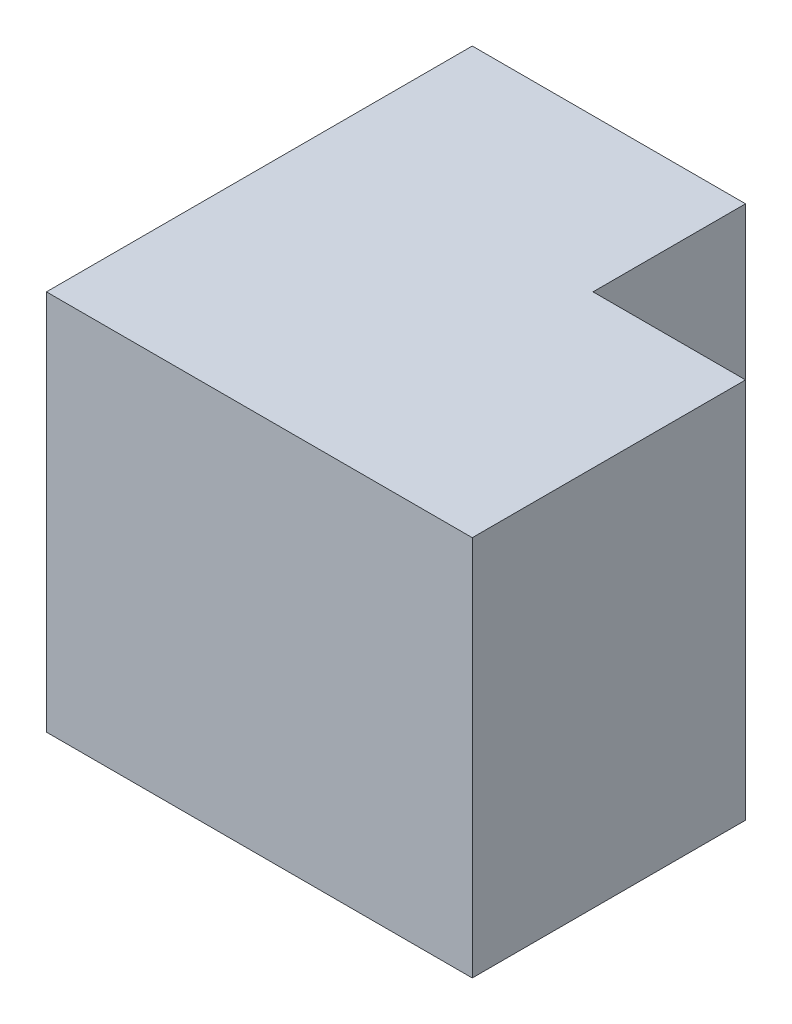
ISO-10303-21;
HEADER;
FILE_DESCRIPTION(('STEP AP214'),'2;1');
FILE_NAME('part.step','',(''),(''),'','','');
FILE_SCHEMA(('AUTOMOTIVE_DESIGN { 1 0 10303 214 1 1 1 1 }'));
ENDSEC;
DATA;
#1=APPLICATION_CONTEXT('core data for automotive mechanical design processes');
#2=APPLICATION_PROTOCOL_DEFINITION('international standard','automotive_design',2000,#1);
#3=PRODUCT_CONTEXT('',#1,'mechanical');
#4=PRODUCT('Part','Part','',(#3));
#5=PRODUCT_RELATED_PRODUCT_CATEGORY('part','',(#4));
#6=PRODUCT_DEFINITION_FORMATION('','',#4);
#7=PRODUCT_DEFINITION_CONTEXT('part definition',#1,'design');
#8=PRODUCT_DEFINITION('design','',#6,#7);
#9=PRODUCT_DEFINITION_SHAPE('','',#8);
#10=(LENGTH_UNIT() NAMED_UNIT(*) SI_UNIT(.MILLI.,.METRE.));
#11=(NAMED_UNIT(*) PLANE_ANGLE_UNIT() SI_UNIT($,.RADIAN.));
#12=(NAMED_UNIT(*) SI_UNIT($,.STERADIAN.) SOLID_ANGLE_UNIT());
#13=UNCERTAINTY_MEASURE_WITH_UNIT(LENGTH_MEASURE(1.E-05),#10,'distance_accuracy_value','');
#14=(GEOMETRIC_REPRESENTATION_CONTEXT(3) GLOBAL_UNCERTAINTY_ASSIGNED_CONTEXT((#13)) GLOBAL_UNIT_ASSIGNED_CONTEXT((#10,
#11,#12)) REPRESENTATION_CONTEXT('',''));
#15=CARTESIAN_POINT('',(0.,0.,0.));
#16=DIRECTION('',(0.,0.,1.));
#17=DIRECTION('',(1.,0.,0.));
#18=AXIS2_PLACEMENT_3D('',#15,#16,#17);
#19=CARTESIAN_POINT('',(9.50000000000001,60.,0.));
#20=DIRECTION('',(1.,0.,0.));
#21=DIRECTION('',(0.,0.,-1.));
#22=AXIS2_PLACEMENT_3D('',#19,#20,#21);
#23=PLANE('',#22);
#24=DIRECTION('',(0.,0.,1.));
#25=VECTOR('',#24,1.);
#26=CARTESIAN_POINT('',(9.50000000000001,0.,0.));
#27=LINE('',#26,#25);
#28=CARTESIAN_POINT('',(9.5,0.,-33.5));
#29=VERTEX_POINT('',#28);
#30=CARTESIAN_POINT('',(9.50000000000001,0.,-9.49999999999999));
#31=VERTEX_POINT('',#30);
#32=EDGE_CURVE('E114',#29,#31,#27,.T.);
#33=ORIENTED_EDGE('',*,*,#32,.F.);
#34=DIRECTION('',(0.,-1.,0.));
#35=VECTOR('',#34,1.);
#36=CARTESIAN_POINT('',(9.5,60.,-33.5));
#37=LINE('',#36,#35);
#38=CARTESIAN_POINT('',(9.5,60.,-33.5));
#39=VERTEX_POINT('',#38);
#40=EDGE_CURVE('E11',#39,#29,#37,.T.);
#41=ORIENTED_EDGE('',*,*,#40,.F.);
#42=DIRECTION('',(0.,0.,1.));
#43=VECTOR('',#42,1.);
#44=CARTESIAN_POINT('',(9.50000000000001,60.,0.));
#45=LINE('',#44,#43);
#46=CARTESIAN_POINT('',(9.50000000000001,60.,-9.49999999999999));
#47=VERTEX_POINT('',#46);
#48=EDGE_CURVE('E127',#39,#47,#45,.T.);
#49=ORIENTED_EDGE('',*,*,#48,.T.);
#50=DIRECTION('',(0.,-1.,0.));
#51=VECTOR('',#50,1.);
#52=CARTESIAN_POINT('',(9.50000000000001,60.,-9.49999999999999));
#53=LINE('',#52,#51);
#54=EDGE_CURVE('E76',#47,#31,#53,.T.);
#55=ORIENTED_EDGE('',*,*,#54,.T.);
#56=EDGE_LOOP('',(#33,#41,#49,#55));
#57=FACE_BOUND('',#56,.T.);
#58=ADVANCED_FACE('F32',(#57),#23,.T.);
#59=CARTESIAN_POINT('',(0.,60.,-33.5));
#60=DIRECTION('',(0.,0.,-1.));
#61=DIRECTION('',(-1.,0.,0.));
#62=AXIS2_PLACEMENT_3D('',#59,#60,#61);
#63=PLANE('',#62);
#64=DIRECTION('',(1.,0.,0.));
#65=VECTOR('',#64,1.);
#66=CARTESIAN_POINT('',(0.,0.,-33.5));
#67=LINE('',#66,#65);
#68=CARTESIAN_POINT('',(-33.5,0.,-33.5));
#69=VERTEX_POINT('',#68);
#70=EDGE_CURVE('E117',#69,#29,#67,.T.);
#71=ORIENTED_EDGE('',*,*,#70,.F.);
#72=DIRECTION('',(0.,-1.,0.));
#73=VECTOR('',#72,1.);
#74=CARTESIAN_POINT('',(-33.5,60.,-33.5));
#75=LINE('',#74,#73);
#76=CARTESIAN_POINT('',(-33.5,60.,-33.5));
#77=VERTEX_POINT('',#76);
#78=EDGE_CURVE('E40',#77,#69,#75,.T.);
#79=ORIENTED_EDGE('',*,*,#78,.F.);
#80=DIRECTION('',(1.,0.,0.));
#81=VECTOR('',#80,1.);
#82=CARTESIAN_POINT('',(0.,60.,-33.5));
#83=LINE('',#82,#81);
#84=EDGE_CURVE('E139',#77,#39,#83,.T.);
#85=ORIENTED_EDGE('',*,*,#84,.T.);
#86=ORIENTED_EDGE('',*,*,#40,.T.);
#87=EDGE_LOOP('',(#71,#79,#85,#86));
#88=FACE_BOUND('',#87,.T.);
#89=ADVANCED_FACE('F138',(#88),#63,.T.);
#90=CARTESIAN_POINT('',(-33.5,60.,0.));
#91=DIRECTION('',(1.,0.,0.));
#92=DIRECTION('',(0.,0.,-1.));
#93=AXIS2_PLACEMENT_3D('',#90,#91,#92);
#94=PLANE('',#93);
#95=DIRECTION('',(0.,0.,1.));
#96=VECTOR('',#95,1.);
#97=CARTESIAN_POINT('',(-33.5,0.,0.));
#98=LINE('',#97,#96);
#99=CARTESIAN_POINT('',(-33.5,0.,33.5));
#100=VERTEX_POINT('',#99);
#101=EDGE_CURVE('E120',#69,#100,#98,.T.);
#102=ORIENTED_EDGE('',*,*,#101,.T.);
#103=DIRECTION('',(0.,-1.,0.));
#104=VECTOR('',#103,1.);
#105=CARTESIAN_POINT('',(-33.5,60.,33.5));
#106=LINE('',#105,#104);
#107=CARTESIAN_POINT('',(-33.5,60.,33.5));
#108=VERTEX_POINT('',#107);
#109=EDGE_CURVE('E107',#108,#100,#106,.T.);
#110=ORIENTED_EDGE('',*,*,#109,.F.);
#111=DIRECTION('',(0.,0.,1.));
#112=VECTOR('',#111,1.);
#113=CARTESIAN_POINT('',(-33.5,60.,0.));
#114=LINE('',#113,#112);
#115=EDGE_CURVE('E94',#77,#108,#114,.T.);
#116=ORIENTED_EDGE('',*,*,#115,.F.);
#117=ORIENTED_EDGE('',*,*,#78,.T.);
#118=EDGE_LOOP('',(#102,#110,#116,#117));
#119=FACE_BOUND('',#118,.T.);
#120=ADVANCED_FACE('F132',(#119),#94,.F.);
#121=CARTESIAN_POINT('',(0.,60.,33.5));
#122=DIRECTION('',(0.,0.,-1.));
#123=DIRECTION('',(-1.,0.,0.));
#124=AXIS2_PLACEMENT_3D('',#121,#122,#123);
#125=PLANE('',#124);
#126=DIRECTION('',(1.,0.,0.));
#127=VECTOR('',#126,1.);
#128=CARTESIAN_POINT('',(0.,0.,33.5));
#129=LINE('',#128,#127);
#130=CARTESIAN_POINT('',(33.5,0.,33.5));
#131=VERTEX_POINT('',#130);
#132=EDGE_CURVE('E103',#100,#131,#129,.T.);
#133=ORIENTED_EDGE('',*,*,#132,.T.);
#134=DIRECTION('',(0.,-1.,0.));
#135=VECTOR('',#134,1.);
#136=CARTESIAN_POINT('',(33.5,60.,33.5));
#137=LINE('',#136,#135);
#138=CARTESIAN_POINT('',(33.5,60.,33.5));
#139=VERTEX_POINT('',#138);
#140=EDGE_CURVE('E100',#139,#131,#137,.T.);
#141=ORIENTED_EDGE('',*,*,#140,.F.);
#142=DIRECTION('',(1.,0.,0.));
#143=VECTOR('',#142,1.);
#144=CARTESIAN_POINT('',(0.,60.,33.5));
#145=LINE('',#144,#143);
#146=EDGE_CURVE('E87',#108,#139,#145,.T.);
#147=ORIENTED_EDGE('',*,*,#146,.F.);
#148=ORIENTED_EDGE('',*,*,#109,.T.);
#149=EDGE_LOOP('',(#133,#141,#147,#148));
#150=FACE_BOUND('',#149,.T.);
#151=ADVANCED_FACE('F101',(#150),#125,.F.);
#152=CARTESIAN_POINT('',(33.5,60.,0.));
#153=DIRECTION('',(1.,0.,0.));
#154=DIRECTION('',(0.,0.,-1.));
#155=AXIS2_PLACEMENT_3D('',#152,#153,#154);
#156=PLANE('',#155);
#157=DIRECTION('',(0.,0.,1.));
#158=VECTOR('',#157,1.);
#159=CARTESIAN_POINT('',(33.5,0.,0.));
#160=LINE('',#159,#158);
#161=CARTESIAN_POINT('',(33.5,0.,-9.49999999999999));
#162=VERTEX_POINT('',#161);
#163=EDGE_CURVE('E123',#162,#131,#160,.T.);
#164=ORIENTED_EDGE('',*,*,#163,.F.);
#165=DIRECTION('',(0.,-1.,0.));
#166=VECTOR('',#165,1.);
#167=CARTESIAN_POINT('',(33.5,60.,-9.49999999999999));
#168=LINE('',#167,#166);
#169=CARTESIAN_POINT('',(33.5,60.,-9.49999999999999));
#170=VERTEX_POINT('',#169);
#171=EDGE_CURVE('E69',#170,#162,#168,.T.);
#172=ORIENTED_EDGE('',*,*,#171,.F.);
#173=DIRECTION('',(0.,0.,1.));
#174=VECTOR('',#173,1.);
#175=CARTESIAN_POINT('',(33.5,60.,0.));
#176=LINE('',#175,#174);
#177=EDGE_CURVE('E91',#170,#139,#176,.T.);
#178=ORIENTED_EDGE('',*,*,#177,.T.);
#179=ORIENTED_EDGE('',*,*,#140,.T.);
#180=EDGE_LOOP('',(#164,#172,#178,#179));
#181=FACE_BOUND('',#180,.T.);
#182=ADVANCED_FACE('F109',(#181),#156,.T.);
#183=CARTESIAN_POINT('',(0.,60.,-9.49999999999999));
#184=DIRECTION('',(0.,0.,1.));
#185=DIRECTION('',(1.,0.,0.));
#186=AXIS2_PLACEMENT_3D('',#183,#184,#185);
#187=PLANE('',#186);
#188=DIRECTION('',(-1.,0.,0.));
#189=VECTOR('',#188,1.);
#190=CARTESIAN_POINT('',(0.,0.,-9.49999999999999));
#191=LINE('',#190,#189);
#192=EDGE_CURVE('E125',#162,#31,#191,.T.);
#193=ORIENTED_EDGE('',*,*,#192,.T.);
#194=ORIENTED_EDGE('',*,*,#54,.F.);
#195=DIRECTION('',(-1.,0.,0.));
#196=VECTOR('',#195,1.);
#197=CARTESIAN_POINT('',(0.,60.,-9.49999999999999));
#198=LINE('',#197,#196);
#199=EDGE_CURVE('E48',#170,#47,#198,.T.);
#200=ORIENTED_EDGE('',*,*,#199,.F.);
#201=ORIENTED_EDGE('',*,*,#171,.T.);
#202=EDGE_LOOP('',(#193,#194,#200,#201));
#203=FACE_BOUND('',#202,.T.);
#204=ADVANCED_FACE('F140',(#203),#187,.F.);
#205=CARTESIAN_POINT('',(0.,60.,0.));
#206=DIRECTION('',(0.,1.,0.));
#207=DIRECTION('',(0.,0.,1.));
#208=AXIS2_PLACEMENT_3D('',#205,#206,#207);
#209=PLANE('',#208);
#210=ORIENTED_EDGE('',*,*,#48,.F.);
#211=ORIENTED_EDGE('',*,*,#84,.F.);
#212=ORIENTED_EDGE('',*,*,#115,.T.);
#213=ORIENTED_EDGE('',*,*,#146,.T.);
#214=ORIENTED_EDGE('',*,*,#177,.F.);
#215=ORIENTED_EDGE('',*,*,#199,.T.);
#216=EDGE_LOOP('',(#210,#211,#212,#213,#214,#215));
#217=FACE_BOUND('',#216,.T.);
#218=ADVANCED_FACE('F89',(#217),#209,.T.);
#219=CARTESIAN_POINT('',(0.,0.,0.));
#220=DIRECTION('',(0.,1.,0.));
#221=DIRECTION('',(0.,0.,1.));
#222=AXIS2_PLACEMENT_3D('',#219,#220,#221);
#223=PLANE('',#222);
#224=ORIENTED_EDGE('',*,*,#32,.T.);
#225=ORIENTED_EDGE('',*,*,#192,.F.);
#226=ORIENTED_EDGE('',*,*,#163,.T.);
#227=ORIENTED_EDGE('',*,*,#132,.F.);
#228=ORIENTED_EDGE('',*,*,#101,.F.);
#229=ORIENTED_EDGE('',*,*,#70,.T.);
#230=EDGE_LOOP('',(#224,#225,#226,#227,#228,#229));
#231=FACE_BOUND('',#230,.T.);
#232=ADVANCED_FACE('F137',(#231),#223,.F.);
#233=CLOSED_SHELL('',(#58,#89,#120,#151,#182,#204,#218,#232));
#234=MANIFOLD_SOLID_BREP('B2',#233);
#235=ADVANCED_BREP_SHAPE_REPRESENTATION('',(#18,#234),#14);
#236=SHAPE_DEFINITION_REPRESENTATION(#9,#235);
ENDSEC;
END-ISO-10303-21;
